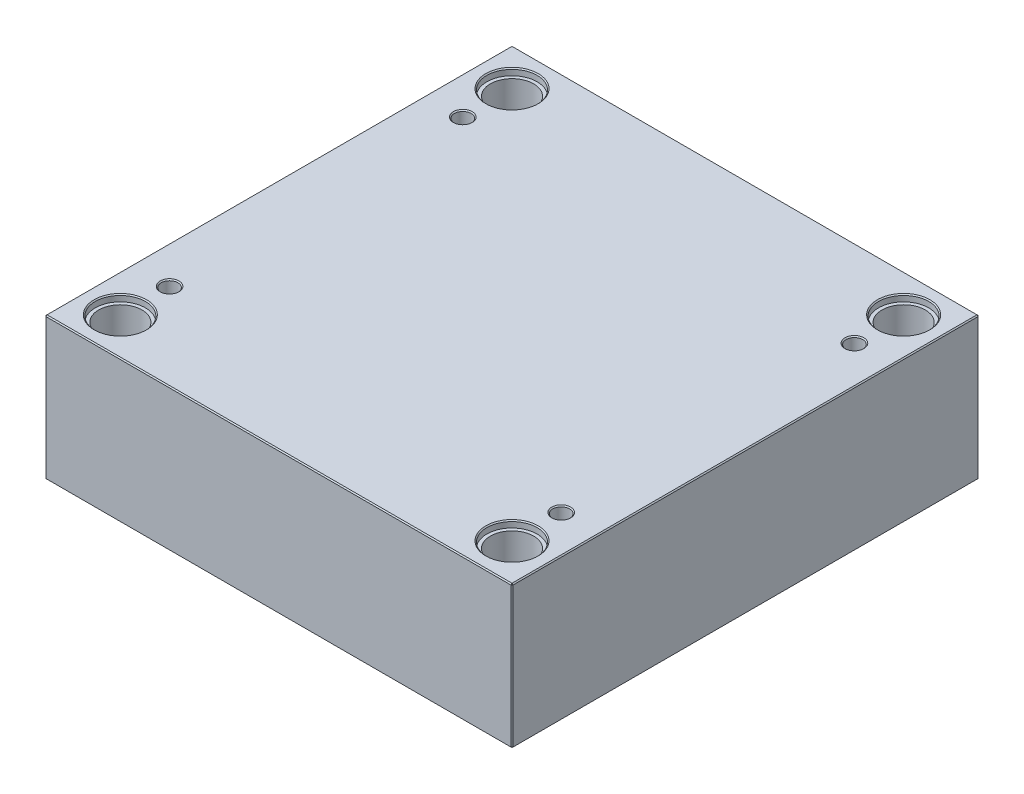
ISO-10303-21;
HEADER;
FILE_DESCRIPTION(('STEP AP214'),'2;1');
FILE_NAME('part.step','',(''),(''),'','','');
FILE_SCHEMA(('AUTOMOTIVE_DESIGN { 1 0 10303 214 1 1 1 1 }'));
ENDSEC;
DATA;
#1=APPLICATION_CONTEXT('core data for automotive mechanical design processes');
#2=APPLICATION_PROTOCOL_DEFINITION('international standard','automotive_design',2000,#1);
#3=PRODUCT_CONTEXT('',#1,'mechanical');
#4=PRODUCT('Part','Part','',(#3));
#5=PRODUCT_RELATED_PRODUCT_CATEGORY('part','',(#4));
#6=PRODUCT_DEFINITION_FORMATION('','',#4);
#7=PRODUCT_DEFINITION_CONTEXT('part definition',#1,'design');
#8=PRODUCT_DEFINITION('design','',#6,#7);
#9=PRODUCT_DEFINITION_SHAPE('','',#8);
#10=(LENGTH_UNIT() NAMED_UNIT(*) SI_UNIT(.MILLI.,.METRE.));
#11=(NAMED_UNIT(*) PLANE_ANGLE_UNIT() SI_UNIT($,.RADIAN.));
#12=(NAMED_UNIT(*) SI_UNIT($,.STERADIAN.) SOLID_ANGLE_UNIT());
#13=UNCERTAINTY_MEASURE_WITH_UNIT(LENGTH_MEASURE(1.E-05),#10,'distance_accuracy_value','');
#14=(GEOMETRIC_REPRESENTATION_CONTEXT(3) GLOBAL_UNCERTAINTY_ASSIGNED_CONTEXT((#13)) GLOBAL_UNIT_ASSIGNED_CONTEXT((#10,
#11,#12)) REPRESENTATION_CONTEXT('',''));
#15=CARTESIAN_POINT('',(0.,0.,0.));
#16=DIRECTION('',(0.,0.,1.));
#17=DIRECTION('',(1.,0.,0.));
#18=AXIS2_PLACEMENT_3D('',#15,#16,#17);
#19=CARTESIAN_POINT('',(-187.,0.,-187.));
#20=DIRECTION('',(0.,1.,0.));
#21=DIRECTION('',(0.,0.,1.));
#22=AXIS2_PLACEMENT_3D('',#19,#20,#21);
#23=CYLINDRICAL_SURFACE('',#22,20.65);
#24=CARTESIAN_POINT('',(-187.,0.999999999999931,-187.));
#25=DIRECTION('',(0.,1.,0.));
#26=DIRECTION('',(0.,0.,1.));
#27=AXIS2_PLACEMENT_3D('',#24,#25,#26);
#28=CIRCLE('',#27,20.65);
#29=CARTESIAN_POINT('',(-187.,0.999999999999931,-166.35));
#30=VERTEX_POINT('',#29);
#31=EDGE_CURVE('E472',#30,#30,#28,.F.);
#32=ORIENTED_EDGE('',*,*,#31,.T.);
#33=EDGE_LOOP('',(#32));
#34=FACE_BOUND('',#33,.T.);
#35=CARTESIAN_POINT('',(-187.,129.7,-187.));
#36=DIRECTION('',(0.,1.,0.));
#37=DIRECTION('',(0.,0.,1.));
#38=AXIS2_PLACEMENT_3D('',#35,#36,#37);
#39=CIRCLE('',#38,20.65);
#40=CARTESIAN_POINT('',(-187.,129.7,-166.35));
#41=VERTEX_POINT('',#40);
#42=EDGE_CURVE('E221',#41,#41,#39,.F.);
#43=ORIENTED_EDGE('',*,*,#42,.F.);
#44=EDGE_LOOP('',(#43));
#45=FACE_BOUND('',#44,.T.);
#46=ADVANCED_FACE('F16',(#34,#45),#23,.F.);
#47=CARTESIAN_POINT('',(187.,0.,-187.));
#48=DIRECTION('',(0.,1.,0.));
#49=DIRECTION('',(0.,0.,1.));
#50=AXIS2_PLACEMENT_3D('',#47,#48,#49);
#51=CYLINDRICAL_SURFACE('',#50,20.65);
#52=CARTESIAN_POINT('',(187.,0.999999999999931,-187.));
#53=DIRECTION('',(0.,1.,0.));
#54=DIRECTION('',(0.,0.,1.));
#55=AXIS2_PLACEMENT_3D('',#52,#53,#54);
#56=CIRCLE('',#55,20.65);
#57=CARTESIAN_POINT('',(187.,0.999999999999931,-166.35));
#58=VERTEX_POINT('',#57);
#59=EDGE_CURVE('E474',#58,#58,#56,.F.);
#60=ORIENTED_EDGE('',*,*,#59,.T.);
#61=EDGE_LOOP('',(#60));
#62=FACE_BOUND('',#61,.T.);
#63=CARTESIAN_POINT('',(187.,129.7,-187.));
#64=DIRECTION('',(0.,1.,0.));
#65=DIRECTION('',(0.,0.,1.));
#66=AXIS2_PLACEMENT_3D('',#63,#64,#65);
#67=CIRCLE('',#66,20.65);
#68=CARTESIAN_POINT('',(187.,129.7,-166.35));
#69=VERTEX_POINT('',#68);
#70=EDGE_CURVE('E218',#69,#69,#67,.F.);
#71=ORIENTED_EDGE('',*,*,#70,.F.);
#72=EDGE_LOOP('',(#71));
#73=FACE_BOUND('',#72,.T.);
#74=ADVANCED_FACE('F263',(#62,#73),#51,.F.);
#75=CARTESIAN_POINT('',(187.,0.,187.));
#76=DIRECTION('',(0.,1.,0.));
#77=DIRECTION('',(0.,0.,1.));
#78=AXIS2_PLACEMENT_3D('',#75,#76,#77);
#79=CYLINDRICAL_SURFACE('',#78,20.65);
#80=CARTESIAN_POINT('',(187.,0.999999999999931,187.));
#81=DIRECTION('',(0.,1.,0.));
#82=DIRECTION('',(0.,0.,1.));
#83=AXIS2_PLACEMENT_3D('',#80,#81,#82);
#84=CIRCLE('',#83,20.65);
#85=CARTESIAN_POINT('',(187.,0.999999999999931,207.65));
#86=VERTEX_POINT('',#85);
#87=EDGE_CURVE('E477',#86,#86,#84,.F.);
#88=ORIENTED_EDGE('',*,*,#87,.T.);
#89=EDGE_LOOP('',(#88));
#90=FACE_BOUND('',#89,.T.);
#91=CARTESIAN_POINT('',(187.,129.7,187.));
#92=DIRECTION('',(0.,1.,0.));
#93=DIRECTION('',(0.,0.,1.));
#94=AXIS2_PLACEMENT_3D('',#91,#92,#93);
#95=CIRCLE('',#94,20.65);
#96=CARTESIAN_POINT('',(187.,129.7,207.65));
#97=VERTEX_POINT('',#96);
#98=EDGE_CURVE('E214',#97,#97,#95,.F.);
#99=ORIENTED_EDGE('',*,*,#98,.F.);
#100=EDGE_LOOP('',(#99));
#101=FACE_BOUND('',#100,.T.);
#102=ADVANCED_FACE('F270',(#90,#101),#79,.F.);
#103=CARTESIAN_POINT('',(-187.,0.,187.));
#104=DIRECTION('',(0.,1.,0.));
#105=DIRECTION('',(0.,0.,1.));
#106=AXIS2_PLACEMENT_3D('',#103,#104,#105);
#107=CYLINDRICAL_SURFACE('',#106,20.65);
#108=CARTESIAN_POINT('',(-187.,0.999999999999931,187.));
#109=DIRECTION('',(0.,1.,0.));
#110=DIRECTION('',(0.,0.,1.));
#111=AXIS2_PLACEMENT_3D('',#108,#109,#110);
#112=CIRCLE('',#111,20.65);
#113=CARTESIAN_POINT('',(-187.,0.999999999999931,207.65));
#114=VERTEX_POINT('',#113);
#115=EDGE_CURVE('E480',#114,#114,#112,.F.);
#116=ORIENTED_EDGE('',*,*,#115,.T.);
#117=EDGE_LOOP('',(#116));
#118=FACE_BOUND('',#117,.T.);
#119=CARTESIAN_POINT('',(-187.,129.7,187.));
#120=DIRECTION('',(0.,1.,0.));
#121=DIRECTION('',(0.,0.,1.));
#122=AXIS2_PLACEMENT_3D('',#119,#120,#121);
#123=CIRCLE('',#122,20.65);
#124=CARTESIAN_POINT('',(-187.,129.7,207.65));
#125=VERTEX_POINT('',#124);
#126=EDGE_CURVE('E211',#125,#125,#123,.F.);
#127=ORIENTED_EDGE('',*,*,#126,.F.);
#128=EDGE_LOOP('',(#127));
#129=FACE_BOUND('',#128,.T.);
#130=ADVANCED_FACE('F277',(#118,#129),#107,.F.);
#131=CARTESIAN_POINT('',(-223.,136.,223.));
#132=DIRECTION('',(1.,0.,0.));
#133=DIRECTION('',(0.,0.,-1.));
#134=AXIS2_PLACEMENT_3D('',#131,#132,#133);
#135=PLANE('',#134);
#136=DIRECTION('',(0.,-1.,0.));
#137=VECTOR('',#136,1.);
#138=CARTESIAN_POINT('',(-223.,136.,-222.));
#139=LINE('',#138,#137);
#140=CARTESIAN_POINT('',(-223.,135.,-222.));
#141=VERTEX_POINT('',#140);
#142=CARTESIAN_POINT('',(-223.,0.999999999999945,-222.));
#143=VERTEX_POINT('',#142);
#144=EDGE_CURVE('E487',#141,#143,#139,.T.);
#145=ORIENTED_EDGE('',*,*,#144,.T.);
#146=DIRECTION('',(0.,0.,1.));
#147=VECTOR('',#146,1.);
#148=CARTESIAN_POINT('',(-223.,0.999999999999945,223.));
#149=LINE('',#148,#147);
#150=CARTESIAN_POINT('',(-223.,0.999999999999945,222.));
#151=VERTEX_POINT('',#150);
#152=EDGE_CURVE('E490',#143,#151,#149,.T.);
#153=ORIENTED_EDGE('',*,*,#152,.T.);
#154=DIRECTION('',(0.,1.,0.));
#155=VECTOR('',#154,1.);
#156=CARTESIAN_POINT('',(-223.,136.,222.));
#157=LINE('',#156,#155);
#158=CARTESIAN_POINT('',(-223.,135.,222.));
#159=VERTEX_POINT('',#158);
#160=EDGE_CURVE('E485',#151,#159,#157,.T.);
#161=ORIENTED_EDGE('',*,*,#160,.T.);
#162=DIRECTION('',(0.,0.,-1.));
#163=VECTOR('',#162,1.);
#164=CARTESIAN_POINT('',(-223.,135.,-223.));
#165=LINE('',#164,#163);
#166=EDGE_CURVE('E483',#159,#141,#165,.T.);
#167=ORIENTED_EDGE('',*,*,#166,.T.);
#168=EDGE_LOOP('',(#145,#153,#161,#167));
#169=FACE_BOUND('',#168,.T.);
#170=ADVANCED_FACE('F298',(#169),#135,.F.);
#171=CARTESIAN_POINT('',(223.,136.,223.));
#172=DIRECTION('',(0.,0.,-1.));
#173=DIRECTION('',(-1.,0.,0.));
#174=AXIS2_PLACEMENT_3D('',#171,#172,#173);
#175=PLANE('',#174);
#176=DIRECTION('',(-1.,0.,0.));
#177=VECTOR('',#176,1.);
#178=CARTESIAN_POINT('',(-223.,135.,223.));
#179=LINE('',#178,#177);
#180=CARTESIAN_POINT('',(222.,135.,223.));
#181=VERTEX_POINT('',#180);
#182=CARTESIAN_POINT('',(-222.,135.,223.));
#183=VERTEX_POINT('',#182);
#184=EDGE_CURVE('E509',#181,#183,#179,.T.);
#185=ORIENTED_EDGE('',*,*,#184,.T.);
#186=DIRECTION('',(0.,-1.,0.));
#187=VECTOR('',#186,1.);
#188=CARTESIAN_POINT('',(-222.,136.,223.));
#189=LINE('',#188,#187);
#190=CARTESIAN_POINT('',(-222.,0.999999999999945,223.));
#191=VERTEX_POINT('',#190);
#192=EDGE_CURVE('E515',#183,#191,#189,.T.);
#193=ORIENTED_EDGE('',*,*,#192,.T.);
#194=DIRECTION('',(1.,0.,0.));
#195=VECTOR('',#194,1.);
#196=CARTESIAN_POINT('',(223.,0.999999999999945,223.));
#197=LINE('',#196,#195);
#198=CARTESIAN_POINT('',(222.,0.999999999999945,223.));
#199=VERTEX_POINT('',#198);
#200=EDGE_CURVE('E513',#191,#199,#197,.T.);
#201=ORIENTED_EDGE('',*,*,#200,.T.);
#202=DIRECTION('',(0.,1.,0.));
#203=VECTOR('',#202,1.);
#204=CARTESIAN_POINT('',(222.,136.,223.));
#205=LINE('',#204,#203);
#206=EDGE_CURVE('E511',#199,#181,#205,.T.);
#207=ORIENTED_EDGE('',*,*,#206,.T.);
#208=EDGE_LOOP('',(#185,#193,#201,#207));
#209=FACE_BOUND('',#208,.T.);
#210=ADVANCED_FACE('F294',(#209),#175,.F.);
#211=CARTESIAN_POINT('',(223.,136.,223.));
#212=DIRECTION('',(-1.,0.,0.));
#213=DIRECTION('',(0.,0.,1.));
#214=AXIS2_PLACEMENT_3D('',#211,#212,#213);
#215=PLANE('',#214);
#216=DIRECTION('',(0.,0.,-1.));
#217=VECTOR('',#216,1.);
#218=CARTESIAN_POINT('',(223.,0.999999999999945,223.));
#219=LINE('',#218,#217);
#220=CARTESIAN_POINT('',(223.,0.999999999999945,222.));
#221=VERTEX_POINT('',#220);
#222=CARTESIAN_POINT('',(223.,0.999999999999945,-222.));
#223=VERTEX_POINT('',#222);
#224=EDGE_CURVE('E504',#221,#223,#219,.T.);
#225=ORIENTED_EDGE('',*,*,#224,.T.);
#226=DIRECTION('',(0.,1.,0.));
#227=VECTOR('',#226,1.);
#228=CARTESIAN_POINT('',(223.,136.,-222.));
#229=LINE('',#228,#227);
#230=CARTESIAN_POINT('',(223.,135.,-222.));
#231=VERTEX_POINT('',#230);
#232=EDGE_CURVE('E506',#223,#231,#229,.T.);
#233=ORIENTED_EDGE('',*,*,#232,.T.);
#234=DIRECTION('',(0.,0.,1.));
#235=VECTOR('',#234,1.);
#236=CARTESIAN_POINT('',(223.,135.,223.));
#237=LINE('',#236,#235);
#238=CARTESIAN_POINT('',(223.,135.,222.));
#239=VERTEX_POINT('',#238);
#240=EDGE_CURVE('E500',#231,#239,#237,.T.);
#241=ORIENTED_EDGE('',*,*,#240,.T.);
#242=DIRECTION('',(0.,-1.,0.));
#243=VECTOR('',#242,1.);
#244=CARTESIAN_POINT('',(223.,136.,222.));
#245=LINE('',#244,#243);
#246=EDGE_CURVE('E502',#239,#221,#245,.T.);
#247=ORIENTED_EDGE('',*,*,#246,.T.);
#248=EDGE_LOOP('',(#225,#233,#241,#247));
#249=FACE_BOUND('',#248,.T.);
#250=ADVANCED_FACE('F290',(#249),#215,.F.);
#251=CARTESIAN_POINT('',(223.,136.,-223.));
#252=DIRECTION('',(0.,0.,1.));
#253=DIRECTION('',(1.,0.,0.));
#254=AXIS2_PLACEMENT_3D('',#251,#252,#253);
#255=PLANE('',#254);
#256=DIRECTION('',(0.,-1.,0.));
#257=VECTOR('',#256,1.);
#258=CARTESIAN_POINT('',(222.,136.,-223.));
#259=LINE('',#258,#257);
#260=CARTESIAN_POINT('',(222.,135.,-223.));
#261=VERTEX_POINT('',#260);
#262=CARTESIAN_POINT('',(222.,0.999999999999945,-223.));
#263=VERTEX_POINT('',#262);
#264=EDGE_CURVE('E494',#261,#263,#259,.T.);
#265=ORIENTED_EDGE('',*,*,#264,.T.);
#266=DIRECTION('',(-1.,0.,0.));
#267=VECTOR('',#266,1.);
#268=CARTESIAN_POINT('',(223.,0.999999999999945,-223.));
#269=LINE('',#268,#267);
#270=CARTESIAN_POINT('',(-222.,0.999999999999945,-223.));
#271=VERTEX_POINT('',#270);
#272=EDGE_CURVE('E138',#263,#271,#269,.T.);
#273=ORIENTED_EDGE('',*,*,#272,.T.);
#274=DIRECTION('',(0.,1.,0.));
#275=VECTOR('',#274,1.);
#276=CARTESIAN_POINT('',(-222.,136.,-223.));
#277=LINE('',#276,#275);
#278=CARTESIAN_POINT('',(-222.,135.,-223.));
#279=VERTEX_POINT('',#278);
#280=EDGE_CURVE('E496',#271,#279,#277,.T.);
#281=ORIENTED_EDGE('',*,*,#280,.T.);
#282=DIRECTION('',(1.,0.,0.));
#283=VECTOR('',#282,1.);
#284=CARTESIAN_POINT('',(223.,135.,-223.));
#285=LINE('',#284,#283);
#286=EDGE_CURVE('E492',#279,#261,#285,.T.);
#287=ORIENTED_EDGE('',*,*,#286,.T.);
#288=EDGE_LOOP('',(#265,#273,#281,#287));
#289=FACE_BOUND('',#288,.T.);
#290=ADVANCED_FACE('F282',(#289),#255,.F.);
#291=CARTESIAN_POINT('',(0.,136.,0.));
#292=DIRECTION('',(0.,1.,0.));
#293=DIRECTION('',(0.,0.,1.));
#294=AXIS2_PLACEMENT_3D('',#291,#292,#293);
#295=PLANE('',#294);
#296=CARTESIAN_POINT('',(187.,136.,187.));
#297=DIRECTION('',(0.,1.,0.));
#298=DIRECTION('',(0.,0.,1.));
#299=AXIS2_PLACEMENT_3D('',#296,#297,#298);
#300=CIRCLE('',#299,25.);
#301=CARTESIAN_POINT('',(187.,136.,212.));
#302=VERTEX_POINT('',#301);
#303=EDGE_CURVE('E236',#302,#302,#300,.F.);
#304=ORIENTED_EDGE('',*,*,#303,.T.);
#305=EDGE_LOOP('',(#304));
#306=FACE_BOUND('',#305,.T.);
#307=CARTESIAN_POINT('',(-187.,136.,187.));
#308=DIRECTION('',(0.,1.,0.));
#309=DIRECTION('',(0.,0.,1.));
#310=AXIS2_PLACEMENT_3D('',#307,#308,#309);
#311=CIRCLE('',#310,25.);
#312=CARTESIAN_POINT('',(-187.,136.,212.));
#313=VERTEX_POINT('',#312);
#314=EDGE_CURVE('E233',#313,#313,#311,.F.);
#315=ORIENTED_EDGE('',*,*,#314,.T.);
#316=EDGE_LOOP('',(#315));
#317=FACE_BOUND('',#316,.T.);
#318=CARTESIAN_POINT('',(187.,136.,-187.));
#319=DIRECTION('',(0.,1.,0.));
#320=DIRECTION('',(0.,0.,1.));
#321=AXIS2_PLACEMENT_3D('',#318,#319,#320);
#322=CIRCLE('',#321,25.);
#323=CARTESIAN_POINT('',(187.,136.,-162.));
#324=VERTEX_POINT('',#323);
#325=EDGE_CURVE('E230',#324,#324,#322,.F.);
#326=ORIENTED_EDGE('',*,*,#325,.T.);
#327=EDGE_LOOP('',(#326));
#328=FACE_BOUND('',#327,.T.);
#329=CARTESIAN_POINT('',(-187.,136.,-187.));
#330=DIRECTION('',(0.,1.,0.));
#331=DIRECTION('',(0.,0.,1.));
#332=AXIS2_PLACEMENT_3D('',#329,#330,#331);
#333=CIRCLE('',#332,25.);
#334=CARTESIAN_POINT('',(-187.,136.,-162.));
#335=VERTEX_POINT('',#334);
#336=EDGE_CURVE('E227',#335,#335,#333,.F.);
#337=ORIENTED_EDGE('',*,*,#336,.T.);
#338=EDGE_LOOP('',(#337));
#339=FACE_BOUND('',#338,.T.);
#340=CARTESIAN_POINT('',(-187.,136.,140.));
#341=DIRECTION('',(0.,1.,0.));
#342=DIRECTION('',(0.,0.,1.));
#343=AXIS2_PLACEMENT_3D('',#340,#341,#342);
#344=CIRCLE('',#343,9.);
#345=CARTESIAN_POINT('',(-187.,136.,149.));
#346=VERTEX_POINT('',#345);
#347=EDGE_CURVE('E198',#346,#346,#344,.F.);
#348=ORIENTED_EDGE('',*,*,#347,.T.);
#349=EDGE_LOOP('',(#348));
#350=FACE_BOUND('',#349,.T.);
#351=CARTESIAN_POINT('',(187.,136.,140.));
#352=DIRECTION('',(0.,1.,0.));
#353=DIRECTION('',(0.,0.,1.));
#354=AXIS2_PLACEMENT_3D('',#351,#352,#353);
#355=CIRCLE('',#354,9.);
#356=CARTESIAN_POINT('',(187.,136.,149.));
#357=VERTEX_POINT('',#356);
#358=EDGE_CURVE('E195',#357,#357,#355,.F.);
#359=ORIENTED_EDGE('',*,*,#358,.T.);
#360=EDGE_LOOP('',(#359));
#361=FACE_BOUND('',#360,.T.);
#362=CARTESIAN_POINT('',(187.,136.,-140.));
#363=DIRECTION('',(0.,1.,0.));
#364=DIRECTION('',(0.,0.,1.));
#365=AXIS2_PLACEMENT_3D('',#362,#363,#364);
#366=CIRCLE('',#365,9.);
#367=CARTESIAN_POINT('',(187.,136.,-131.));
#368=VERTEX_POINT('',#367);
#369=EDGE_CURVE('E192',#368,#368,#366,.F.);
#370=ORIENTED_EDGE('',*,*,#369,.T.);
#371=EDGE_LOOP('',(#370));
#372=FACE_BOUND('',#371,.T.);
#373=CARTESIAN_POINT('',(-187.,136.,-140.));
#374=DIRECTION('',(0.,1.,0.));
#375=DIRECTION('',(0.,0.,1.));
#376=AXIS2_PLACEMENT_3D('',#373,#374,#375);
#377=CIRCLE('',#376,9.);
#378=CARTESIAN_POINT('',(-187.,136.,-131.));
#379=VERTEX_POINT('',#378);
#380=EDGE_CURVE('E188',#379,#379,#377,.F.);
#381=ORIENTED_EDGE('',*,*,#380,.T.);
#382=EDGE_LOOP('',(#381));
#383=FACE_BOUND('',#382,.T.);
#384=DIRECTION('',(0.,0.,-1.));
#385=VECTOR('',#384,1.);
#386=CARTESIAN_POINT('',(222.,136.,-223.));
#387=LINE('',#386,#385);
#388=CARTESIAN_POINT('',(222.,136.,222.));
#389=VERTEX_POINT('',#388);
#390=CARTESIAN_POINT('',(222.,136.,-222.));
#391=VERTEX_POINT('',#390);
#392=EDGE_CURVE('E31',#389,#391,#387,.T.);
#393=ORIENTED_EDGE('',*,*,#392,.T.);
#394=DIRECTION('',(-1.,0.,0.));
#395=VECTOR('',#394,1.);
#396=CARTESIAN_POINT('',(-223.,136.,-222.));
#397=LINE('',#396,#395);
#398=CARTESIAN_POINT('',(-222.,136.,-222.));
#399=VERTEX_POINT('',#398);
#400=EDGE_CURVE('E189',#391,#399,#397,.T.);
#401=ORIENTED_EDGE('',*,*,#400,.T.);
#402=DIRECTION('',(0.,0.,1.));
#403=VECTOR('',#402,1.);
#404=CARTESIAN_POINT('',(-222.,136.,223.));
#405=LINE('',#404,#403);
#406=CARTESIAN_POINT('',(-222.,136.,222.));
#407=VERTEX_POINT('',#406);
#408=EDGE_CURVE('E518',#399,#407,#405,.T.);
#409=ORIENTED_EDGE('',*,*,#408,.T.);
#410=DIRECTION('',(1.,0.,0.));
#411=VECTOR('',#410,1.);
#412=CARTESIAN_POINT('',(223.,136.,222.));
#413=LINE('',#412,#411);
#414=EDGE_CURVE('E36',#407,#389,#413,.T.);
#415=ORIENTED_EDGE('',*,*,#414,.T.);
#416=EDGE_LOOP('',(#393,#401,#409,#415));
#417=FACE_BOUND('',#416,.T.);
#418=ADVANCED_FACE('F279',(#306,#317,#328,#339,#350,#361,#372,#383,#417),#295,.T.);
#419=CARTESIAN_POINT('',(0.,0.,0.));
#420=DIRECTION('',(0.,1.,0.));
#421=DIRECTION('',(0.,0.,1.));
#422=AXIS2_PLACEMENT_3D('',#419,#420,#421);
#423=PLANE('',#422);
#424=CARTESIAN_POINT('',(-187.,0.,-187.));
#425=DIRECTION('',(0.,1.,0.));
#426=DIRECTION('',(0.,0.,1.));
#427=AXIS2_PLACEMENT_3D('',#424,#425,#426);
#428=CIRCLE('',#427,21.65);
#429=CARTESIAN_POINT('',(-187.,0.,-165.35));
#430=VERTEX_POINT('',#429);
#431=EDGE_CURVE('E469',#430,#430,#428,.T.);
#432=ORIENTED_EDGE('',*,*,#431,.T.);
#433=EDGE_LOOP('',(#432));
#434=FACE_BOUND('',#433,.T.);
#435=CARTESIAN_POINT('',(187.,0.,-187.));
#436=DIRECTION('',(0.,1.,0.));
#437=DIRECTION('',(0.,0.,1.));
#438=AXIS2_PLACEMENT_3D('',#435,#436,#437);
#439=CIRCLE('',#438,21.65);
#440=CARTESIAN_POINT('',(187.,0.,-165.35));
#441=VERTEX_POINT('',#440);
#442=EDGE_CURVE('E466',#441,#441,#439,.T.);
#443=ORIENTED_EDGE('',*,*,#442,.T.);
#444=EDGE_LOOP('',(#443));
#445=FACE_BOUND('',#444,.T.);
#446=CARTESIAN_POINT('',(187.,0.,187.));
#447=DIRECTION('',(0.,1.,0.));
#448=DIRECTION('',(0.,0.,1.));
#449=AXIS2_PLACEMENT_3D('',#446,#447,#448);
#450=CIRCLE('',#449,21.65);
#451=CARTESIAN_POINT('',(187.,0.,208.65));
#452=VERTEX_POINT('',#451);
#453=EDGE_CURVE('E463',#452,#452,#450,.T.);
#454=ORIENTED_EDGE('',*,*,#453,.T.);
#455=EDGE_LOOP('',(#454));
#456=FACE_BOUND('',#455,.T.);
#457=CARTESIAN_POINT('',(-187.,0.,187.));
#458=DIRECTION('',(0.,1.,0.));
#459=DIRECTION('',(0.,0.,1.));
#460=AXIS2_PLACEMENT_3D('',#457,#458,#459);
#461=CIRCLE('',#460,21.65);
#462=CARTESIAN_POINT('',(-187.,0.,208.65));
#463=VERTEX_POINT('',#462);
#464=EDGE_CURVE('E460',#463,#463,#461,.T.);
#465=ORIENTED_EDGE('',*,*,#464,.T.);
#466=EDGE_LOOP('',(#465));
#467=FACE_BOUND('',#466,.T.);
#468=DIRECTION('',(0.,0.,1.));
#469=VECTOR('',#468,1.);
#470=CARTESIAN_POINT('',(222.,0.,0.));
#471=LINE('',#470,#469);
#472=CARTESIAN_POINT('',(222.,0.,-222.));
#473=VERTEX_POINT('',#472);
#474=CARTESIAN_POINT('',(222.,0.,222.));
#475=VERTEX_POINT('',#474);
#476=EDGE_CURVE('E108',#473,#475,#471,.T.);
#477=ORIENTED_EDGE('',*,*,#476,.T.);
#478=DIRECTION('',(-1.,0.,0.));
#479=VECTOR('',#478,1.);
#480=CARTESIAN_POINT('',(0.,0.,222.));
#481=LINE('',#480,#479);
#482=CARTESIAN_POINT('',(-222.,0.,222.));
#483=VERTEX_POINT('',#482);
#484=EDGE_CURVE('E458',#475,#483,#481,.T.);
#485=ORIENTED_EDGE('',*,*,#484,.T.);
#486=DIRECTION('',(0.,0.,-1.));
#487=VECTOR('',#486,1.);
#488=CARTESIAN_POINT('',(-222.,0.,0.));
#489=LINE('',#488,#487);
#490=CARTESIAN_POINT('',(-222.,0.,-222.));
#491=VERTEX_POINT('',#490);
#492=EDGE_CURVE('E110',#483,#491,#489,.T.);
#493=ORIENTED_EDGE('',*,*,#492,.T.);
#494=DIRECTION('',(1.,0.,0.));
#495=VECTOR('',#494,1.);
#496=CARTESIAN_POINT('',(0.,0.,-222.));
#497=LINE('',#496,#495);
#498=EDGE_CURVE('E104',#491,#473,#497,.T.);
#499=ORIENTED_EDGE('',*,*,#498,.T.);
#500=EDGE_LOOP('',(#477,#485,#493,#499));
#501=FACE_BOUND('',#500,.T.);
#502=ADVANCED_FACE('F106',(#434,#445,#456,#467,#501),#423,.F.);
#503=CARTESIAN_POINT('',(-187.,0.,-187.));
#504=DIRECTION('',(0.,-1.,0.));
#505=DIRECTION('',(0.,0.,-1.));
#506=AXIS2_PLACEMENT_3D('',#503,#504,#505);
#507=CONICAL_SURFACE('',#506,21.65,0.785398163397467);
#508=ORIENTED_EDGE('',*,*,#31,.F.);
#509=EDGE_LOOP('',(#508));
#510=FACE_BOUND('',#509,.T.);
#511=ORIENTED_EDGE('',*,*,#431,.F.);
#512=EDGE_LOOP('',(#511));
#513=FACE_BOUND('',#512,.T.);
#514=ADVANCED_FACE('F286',(#510,#513),#507,.F.);
#515=CARTESIAN_POINT('',(187.,0.,-187.));
#516=DIRECTION('',(0.,-1.,0.));
#517=DIRECTION('',(0.,0.,-1.));
#518=AXIS2_PLACEMENT_3D('',#515,#516,#517);
#519=CONICAL_SURFACE('',#518,21.65,0.785398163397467);
#520=ORIENTED_EDGE('',*,*,#59,.F.);
#521=EDGE_LOOP('',(#520));
#522=FACE_BOUND('',#521,.T.);
#523=ORIENTED_EDGE('',*,*,#442,.F.);
#524=EDGE_LOOP('',(#523));
#525=FACE_BOUND('',#524,.T.);
#526=ADVANCED_FACE('F305',(#522,#525),#519,.F.);
#527=CARTESIAN_POINT('',(187.,0.,187.));
#528=DIRECTION('',(0.,-1.,0.));
#529=DIRECTION('',(0.,0.,-1.));
#530=AXIS2_PLACEMENT_3D('',#527,#528,#529);
#531=CONICAL_SURFACE('',#530,21.65,0.785398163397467);
#532=ORIENTED_EDGE('',*,*,#87,.F.);
#533=EDGE_LOOP('',(#532));
#534=FACE_BOUND('',#533,.T.);
#535=ORIENTED_EDGE('',*,*,#453,.F.);
#536=EDGE_LOOP('',(#535));
#537=FACE_BOUND('',#536,.T.);
#538=ADVANCED_FACE('F309',(#534,#537),#531,.F.);
#539=CARTESIAN_POINT('',(-187.,0.,187.));
#540=DIRECTION('',(0.,-1.,0.));
#541=DIRECTION('',(0.,0.,-1.));
#542=AXIS2_PLACEMENT_3D('',#539,#540,#541);
#543=CONICAL_SURFACE('',#542,21.65,0.785398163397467);
#544=ORIENTED_EDGE('',*,*,#115,.F.);
#545=EDGE_LOOP('',(#544));
#546=FACE_BOUND('',#545,.T.);
#547=ORIENTED_EDGE('',*,*,#464,.F.);
#548=EDGE_LOOP('',(#547));
#549=FACE_BOUND('',#548,.T.);
#550=ADVANCED_FACE('F313',(#546,#549),#543,.F.);
#551=CARTESIAN_POINT('',(223.,136.,222.));
#552=DIRECTION('',(-0.707106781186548,0.,-0.707106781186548));
#553=DIRECTION('',(0.,-1.,0.));
#554=AXIS2_PLACEMENT_3D('',#551,#552,#553);
#555=PLANE('',#554);
#556=DIRECTION('',(-0.707106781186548,0.,0.707106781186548));
#557=VECTOR('',#556,1.);
#558=CARTESIAN_POINT('',(222.,135.,223.));
#559=LINE('',#558,#557);
#560=EDGE_CURVE('E126',#181,#239,#559,.F.);
#561=ORIENTED_EDGE('',*,*,#560,.F.);
#562=ORIENTED_EDGE('',*,*,#206,.F.);
#563=DIRECTION('',(0.707106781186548,0.,-0.707106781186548));
#564=VECTOR('',#563,1.);
#565=CARTESIAN_POINT('',(222.,0.999999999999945,223.));
#566=LINE('',#565,#564);
#567=EDGE_CURVE('E180',#221,#199,#566,.F.);
#568=ORIENTED_EDGE('',*,*,#567,.F.);
#569=ORIENTED_EDGE('',*,*,#246,.F.);
#570=EDGE_LOOP('',(#561,#562,#568,#569));
#571=FACE_BOUND('',#570,.T.);
#572=ADVANCED_FACE('F317',(#571),#555,.F.);
#573=CARTESIAN_POINT('',(222.,135.,223.));
#574=DIRECTION('',(0.577350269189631,0.577350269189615,0.577350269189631));
#575=DIRECTION('',(0.707106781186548,0.,-0.707106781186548));
#576=AXIS2_PLACEMENT_3D('',#573,#574,#575);
#577=PLANE('',#576);
#578=DIRECTION('',(0.,-0.707106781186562,0.707106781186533));
#579=VECTOR('',#578,1.);
#580=CARTESIAN_POINT('',(222.,135.,223.));
#581=LINE('',#580,#579);
#582=EDGE_CURVE('E175',#181,#389,#581,.F.);
#583=ORIENTED_EDGE('',*,*,#582,.F.);
#584=ORIENTED_EDGE('',*,*,#560,.T.);
#585=DIRECTION('',(-0.707106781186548,0.707106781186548,0.));
#586=VECTOR('',#585,1.);
#587=CARTESIAN_POINT('',(222.5,135.5,222.));
#588=LINE('',#587,#586);
#589=EDGE_CURVE('E177',#389,#239,#588,.F.);
#590=ORIENTED_EDGE('',*,*,#589,.F.);
#591=EDGE_LOOP('',(#583,#584,#590));
#592=FACE_BOUND('',#591,.T.);
#593=ADVANCED_FACE('F385',(#592),#577,.T.);
#594=CARTESIAN_POINT('',(222.,0.999999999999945,223.));
#595=DIRECTION('',(0.577350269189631,-0.577350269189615,0.577350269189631));
#596=DIRECTION('',(0.707106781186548,0.,-0.707106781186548));
#597=AXIS2_PLACEMENT_3D('',#594,#595,#596);
#598=PLANE('',#597);
#599=DIRECTION('',(-0.707106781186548,-0.707106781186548,0.));
#600=VECTOR('',#599,1.);
#601=CARTESIAN_POINT('',(222.5,0.499999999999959,222.));
#602=LINE('',#601,#600);
#603=EDGE_CURVE('E124',#221,#475,#602,.T.);
#604=ORIENTED_EDGE('',*,*,#603,.F.);
#605=ORIENTED_EDGE('',*,*,#567,.T.);
#606=DIRECTION('',(0.,0.707106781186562,0.707106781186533));
#607=VECTOR('',#606,1.);
#608=CARTESIAN_POINT('',(222.,0.999999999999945,223.));
#609=LINE('',#608,#607);
#610=EDGE_CURVE('E172',#475,#199,#609,.T.);
#611=ORIENTED_EDGE('',*,*,#610,.F.);
#612=EDGE_LOOP('',(#604,#605,#611));
#613=FACE_BOUND('',#612,.T.);
#614=ADVANCED_FACE('F381',(#613),#598,.T.);
#615=CARTESIAN_POINT('',(222.,136.,0.));
#616=DIRECTION('',(0.707106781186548,0.707106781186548,0.));
#617=DIRECTION('',(0.,0.,1.));
#618=AXIS2_PLACEMENT_3D('',#615,#616,#617);
#619=PLANE('',#618);
#620=ORIENTED_EDGE('',*,*,#589,.T.);
#621=ORIENTED_EDGE('',*,*,#240,.F.);
#622=DIRECTION('',(0.707106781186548,-0.707106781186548,0.));
#623=VECTOR('',#622,1.);
#624=CARTESIAN_POINT('',(223.,135.,-222.));
#625=LINE('',#624,#623);
#626=EDGE_CURVE('E166',#391,#231,#625,.T.);
#627=ORIENTED_EDGE('',*,*,#626,.F.);
#628=ORIENTED_EDGE('',*,*,#392,.F.);
#629=EDGE_LOOP('',(#620,#621,#627,#628));
#630=FACE_BOUND('',#629,.T.);
#631=ADVANCED_FACE('F377',(#630),#619,.T.);
#632=CARTESIAN_POINT('',(0.,136.,222.));
#633=DIRECTION('',(0.,0.707106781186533,0.707106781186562));
#634=DIRECTION('',(-1.,0.,0.));
#635=AXIS2_PLACEMENT_3D('',#632,#633,#634);
#636=PLANE('',#635);
#637=ORIENTED_EDGE('',*,*,#582,.T.);
#638=ORIENTED_EDGE('',*,*,#414,.F.);
#639=DIRECTION('',(0.,0.707106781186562,-0.707106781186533));
#640=VECTOR('',#639,1.);
#641=CARTESIAN_POINT('',(-222.,135.5,222.5));
#642=LINE('',#641,#640);
#643=EDGE_CURVE('E163',#183,#407,#642,.T.);
#644=ORIENTED_EDGE('',*,*,#643,.F.);
#645=ORIENTED_EDGE('',*,*,#184,.F.);
#646=EDGE_LOOP('',(#637,#638,#644,#645));
#647=FACE_BOUND('',#646,.T.);
#648=ADVANCED_FACE('F373',(#647),#636,.T.);
#649=CARTESIAN_POINT('',(-222.,136.,223.));
#650=DIRECTION('',(0.707106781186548,0.,-0.707106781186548));
#651=DIRECTION('',(0.,-1.,0.));
#652=AXIS2_PLACEMENT_3D('',#649,#650,#651);
#653=PLANE('',#652);
#654=DIRECTION('',(0.707106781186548,0.,0.707106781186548));
#655=VECTOR('',#654,1.);
#656=CARTESIAN_POINT('',(-222.,0.999999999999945,223.));
#657=LINE('',#656,#655);
#658=EDGE_CURVE('E157',#191,#151,#657,.F.);
#659=ORIENTED_EDGE('',*,*,#658,.F.);
#660=ORIENTED_EDGE('',*,*,#192,.F.);
#661=DIRECTION('',(-0.707106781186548,0.,-0.707106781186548));
#662=VECTOR('',#661,1.);
#663=CARTESIAN_POINT('',(-223.,135.,222.));
#664=LINE('',#663,#662);
#665=EDGE_CURVE('E160',#159,#183,#664,.F.);
#666=ORIENTED_EDGE('',*,*,#665,.F.);
#667=ORIENTED_EDGE('',*,*,#160,.F.);
#668=EDGE_LOOP('',(#659,#660,#666,#667));
#669=FACE_BOUND('',#668,.T.);
#670=ADVANCED_FACE('F369',(#669),#653,.F.);
#671=CARTESIAN_POINT('',(223.,0.999999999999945,223.));
#672=DIRECTION('',(0.,0.707106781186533,-0.707106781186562));
#673=DIRECTION('',(1.,0.,0.));
#674=AXIS2_PLACEMENT_3D('',#671,#672,#673);
#675=PLANE('',#674);
#676=ORIENTED_EDGE('',*,*,#610,.T.);
#677=ORIENTED_EDGE('',*,*,#200,.F.);
#678=DIRECTION('',(0.,-0.707106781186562,-0.707106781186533));
#679=VECTOR('',#678,1.);
#680=CARTESIAN_POINT('',(-222.,0.999999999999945,223.));
#681=LINE('',#680,#679);
#682=EDGE_CURVE('E135',#483,#191,#681,.F.);
#683=ORIENTED_EDGE('',*,*,#682,.F.);
#684=ORIENTED_EDGE('',*,*,#484,.F.);
#685=EDGE_LOOP('',(#676,#677,#683,#684));
#686=FACE_BOUND('',#685,.T.);
#687=ADVANCED_FACE('F366',(#686),#675,.F.);
#688=CARTESIAN_POINT('',(223.,0.999999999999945,223.));
#689=DIRECTION('',(-0.707106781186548,0.707106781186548,0.));
#690=DIRECTION('',(0.,0.,-1.));
#691=AXIS2_PLACEMENT_3D('',#688,#689,#690);
#692=PLANE('',#691);
#693=ORIENTED_EDGE('',*,*,#603,.T.);
#694=ORIENTED_EDGE('',*,*,#476,.F.);
#695=DIRECTION('',(0.707106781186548,0.707106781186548,0.));
#696=VECTOR('',#695,1.);
#697=CARTESIAN_POINT('',(222.5,0.499999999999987,-222.));
#698=LINE('',#697,#696);
#699=EDGE_CURVE('E121',#223,#473,#698,.F.);
#700=ORIENTED_EDGE('',*,*,#699,.F.);
#701=ORIENTED_EDGE('',*,*,#224,.F.);
#702=EDGE_LOOP('',(#693,#694,#700,#701));
#703=FACE_BOUND('',#702,.T.);
#704=ADVANCED_FACE('F119',(#703),#692,.F.);
#705=CARTESIAN_POINT('',(222.,136.,-223.));
#706=DIRECTION('',(-0.707106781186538,0.,0.707106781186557));
#707=DIRECTION('',(0.,-1.,0.));
#708=AXIS2_PLACEMENT_3D('',#705,#706,#707);
#709=PLANE('',#708);
#710=DIRECTION('',(0.707106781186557,0.,0.707106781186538));
#711=VECTOR('',#710,1.);
#712=CARTESIAN_POINT('',(223.,135.,-222.));
#713=LINE('',#712,#711);
#714=EDGE_CURVE('E168',#231,#261,#713,.F.);
#715=ORIENTED_EDGE('',*,*,#714,.F.);
#716=ORIENTED_EDGE('',*,*,#232,.F.);
#717=DIRECTION('',(-0.707106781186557,0.,-0.707106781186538));
#718=VECTOR('',#717,1.);
#719=CARTESIAN_POINT('',(222.,0.999999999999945,-223.));
#720=LINE('',#719,#718);
#721=EDGE_CURVE('E134',#263,#223,#720,.F.);
#722=ORIENTED_EDGE('',*,*,#721,.F.);
#723=ORIENTED_EDGE('',*,*,#264,.F.);
#724=EDGE_LOOP('',(#715,#716,#722,#723));
#725=FACE_BOUND('',#724,.T.);
#726=ADVANCED_FACE('F359',(#725),#709,.F.);
#727=CARTESIAN_POINT('',(223.,135.,-222.));
#728=DIRECTION('',(0.577350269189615,0.577350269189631,-0.577350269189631));
#729=DIRECTION('',(0.,0.707106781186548,0.707106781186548));
#730=AXIS2_PLACEMENT_3D('',#727,#728,#729);
#731=PLANE('',#730);
#732=ORIENTED_EDGE('',*,*,#626,.T.);
#733=ORIENTED_EDGE('',*,*,#714,.T.);
#734=DIRECTION('',(0.,0.707106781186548,0.707106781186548));
#735=VECTOR('',#734,1.);
#736=CARTESIAN_POINT('',(222.,135.5,-222.5));
#737=LINE('',#736,#735);
#738=EDGE_CURVE('E152',#391,#261,#737,.F.);
#739=ORIENTED_EDGE('',*,*,#738,.F.);
#740=EDGE_LOOP('',(#732,#733,#739));
#741=FACE_BOUND('',#740,.T.);
#742=ADVANCED_FACE('F355',(#741),#731,.T.);
#743=CARTESIAN_POINT('',(-223.,135.,222.));
#744=DIRECTION('',(-0.577350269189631,0.577350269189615,0.577350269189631));
#745=DIRECTION('',(0.707106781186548,0.,0.707106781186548));
#746=AXIS2_PLACEMENT_3D('',#743,#744,#745);
#747=PLANE('',#746);
#748=ORIENTED_EDGE('',*,*,#665,.T.);
#749=ORIENTED_EDGE('',*,*,#643,.T.);
#750=DIRECTION('',(-0.707106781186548,-0.707106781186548,0.));
#751=VECTOR('',#750,1.);
#752=CARTESIAN_POINT('',(-223.,135.,222.));
#753=LINE('',#752,#751);
#754=EDGE_CURVE('E143',#159,#407,#753,.F.);
#755=ORIENTED_EDGE('',*,*,#754,.F.);
#756=EDGE_LOOP('',(#748,#749,#755));
#757=FACE_BOUND('',#756,.T.);
#758=ADVANCED_FACE('F351',(#757),#747,.T.);
#759=CARTESIAN_POINT('',(-222.,0.999999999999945,223.));
#760=DIRECTION('',(-0.577350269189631,-0.577350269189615,0.577350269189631));
#761=DIRECTION('',(0.707106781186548,0.,0.707106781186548));
#762=AXIS2_PLACEMENT_3D('',#759,#760,#761);
#763=PLANE('',#762);
#764=ORIENTED_EDGE('',*,*,#682,.T.);
#765=ORIENTED_EDGE('',*,*,#658,.T.);
#766=DIRECTION('',(-0.707106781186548,0.707106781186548,0.));
#767=VECTOR('',#766,1.);
#768=CARTESIAN_POINT('',(-222.5,0.499999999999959,222.));
#769=LINE('',#768,#767);
#770=EDGE_CURVE('E139',#483,#151,#769,.T.);
#771=ORIENTED_EDGE('',*,*,#770,.F.);
#772=EDGE_LOOP('',(#764,#765,#771));
#773=FACE_BOUND('',#772,.T.);
#774=ADVANCED_FACE('F348',(#773),#763,.T.);
#775=CARTESIAN_POINT('',(222.,0.999999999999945,-223.));
#776=DIRECTION('',(0.577350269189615,-0.577350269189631,-0.577350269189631));
#777=DIRECTION('',(0.,0.707106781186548,-0.707106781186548));
#778=AXIS2_PLACEMENT_3D('',#775,#776,#777);
#779=PLANE('',#778);
#780=ORIENTED_EDGE('',*,*,#721,.T.);
#781=ORIENTED_EDGE('',*,*,#699,.T.);
#782=DIRECTION('',(0.,-0.707106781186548,0.707106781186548));
#783=VECTOR('',#782,1.);
#784=CARTESIAN_POINT('',(222.,0.999999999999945,-223.));
#785=LINE('',#784,#783);
#786=EDGE_CURVE('E131',#263,#473,#785,.T.);
#787=ORIENTED_EDGE('',*,*,#786,.F.);
#788=EDGE_LOOP('',(#780,#781,#787));
#789=FACE_BOUND('',#788,.T.);
#790=ADVANCED_FACE('F130',(#789),#779,.T.);
#791=CARTESIAN_POINT('',(0.,136.,-222.));
#792=DIRECTION('',(0.,0.707106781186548,-0.707106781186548));
#793=DIRECTION('',(1.,0.,0.));
#794=AXIS2_PLACEMENT_3D('',#791,#792,#793);
#795=PLANE('',#794);
#796=ORIENTED_EDGE('',*,*,#738,.T.);
#797=ORIENTED_EDGE('',*,*,#286,.F.);
#798=DIRECTION('',(0.,-0.707106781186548,-0.707106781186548));
#799=VECTOR('',#798,1.);
#800=CARTESIAN_POINT('',(-222.,135.,-223.));
#801=LINE('',#800,#799);
#802=EDGE_CURVE('E140',#399,#279,#801,.T.);
#803=ORIENTED_EDGE('',*,*,#802,.F.);
#804=ORIENTED_EDGE('',*,*,#400,.F.);
#805=EDGE_LOOP('',(#796,#797,#803,#804));
#806=FACE_BOUND('',#805,.T.);
#807=ADVANCED_FACE('F341',(#806),#795,.T.);
#808=CARTESIAN_POINT('',(-222.,136.,0.));
#809=DIRECTION('',(-0.707106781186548,0.707106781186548,0.));
#810=DIRECTION('',(0.,0.,-1.));
#811=AXIS2_PLACEMENT_3D('',#808,#809,#810);
#812=PLANE('',#811);
#813=ORIENTED_EDGE('',*,*,#754,.T.);
#814=ORIENTED_EDGE('',*,*,#408,.F.);
#815=DIRECTION('',(0.707106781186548,0.707106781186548,0.));
#816=VECTOR('',#815,1.);
#817=CARTESIAN_POINT('',(-222.5,135.5,-222.));
#818=LINE('',#817,#816);
#819=EDGE_CURVE('E146',#141,#399,#818,.T.);
#820=ORIENTED_EDGE('',*,*,#819,.F.);
#821=ORIENTED_EDGE('',*,*,#166,.F.);
#822=EDGE_LOOP('',(#813,#814,#820,#821));
#823=FACE_BOUND('',#822,.T.);
#824=ADVANCED_FACE('F337',(#823),#812,.T.);
#825=CARTESIAN_POINT('',(-223.,0.999999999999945,223.));
#826=DIRECTION('',(0.707106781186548,0.707106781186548,0.));
#827=DIRECTION('',(0.,0.,1.));
#828=AXIS2_PLACEMENT_3D('',#825,#826,#827);
#829=PLANE('',#828);
#830=ORIENTED_EDGE('',*,*,#770,.T.);
#831=ORIENTED_EDGE('',*,*,#152,.F.);
#832=DIRECTION('',(0.707106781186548,-0.707106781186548,0.));
#833=VECTOR('',#832,1.);
#834=CARTESIAN_POINT('',(-223.,0.999999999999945,-222.));
#835=LINE('',#834,#833);
#836=EDGE_CURVE('E529',#491,#143,#835,.F.);
#837=ORIENTED_EDGE('',*,*,#836,.F.);
#838=ORIENTED_EDGE('',*,*,#492,.F.);
#839=EDGE_LOOP('',(#830,#831,#837,#838));
#840=FACE_BOUND('',#839,.T.);
#841=ADVANCED_FACE('F334',(#840),#829,.F.);
#842=CARTESIAN_POINT('',(223.,0.999999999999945,-223.));
#843=DIRECTION('',(0.,0.707106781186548,0.707106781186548));
#844=DIRECTION('',(-1.,0.,0.));
#845=AXIS2_PLACEMENT_3D('',#842,#843,#844);
#846=PLANE('',#845);
#847=ORIENTED_EDGE('',*,*,#786,.T.);
#848=ORIENTED_EDGE('',*,*,#498,.F.);
#849=DIRECTION('',(0.,0.707106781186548,-0.707106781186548));
#850=VECTOR('',#849,1.);
#851=CARTESIAN_POINT('',(-222.,0.499999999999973,-222.5));
#852=LINE('',#851,#850);
#853=EDGE_CURVE('E526',#271,#491,#852,.F.);
#854=ORIENTED_EDGE('',*,*,#853,.F.);
#855=ORIENTED_EDGE('',*,*,#272,.F.);
#856=EDGE_LOOP('',(#847,#848,#854,#855));
#857=FACE_BOUND('',#856,.T.);
#858=ADVANCED_FACE('F137',(#857),#846,.F.);
#859=CARTESIAN_POINT('',(-222.,135.,-223.));
#860=DIRECTION('',(-0.577350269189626,0.577350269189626,-0.577350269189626));
#861=DIRECTION('',(-0.707106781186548,0.,0.707106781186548));
#862=AXIS2_PLACEMENT_3D('',#859,#860,#861);
#863=PLANE('',#862);
#864=ORIENTED_EDGE('',*,*,#819,.T.);
#865=ORIENTED_EDGE('',*,*,#802,.T.);
#866=DIRECTION('',(0.707106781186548,0.,-0.707106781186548));
#867=VECTOR('',#866,1.);
#868=CARTESIAN_POINT('',(-222.,135.,-223.));
#869=LINE('',#868,#867);
#870=EDGE_CURVE('E524',#141,#279,#869,.T.);
#871=ORIENTED_EDGE('',*,*,#870,.F.);
#872=EDGE_LOOP('',(#864,#865,#871));
#873=FACE_BOUND('',#872,.T.);
#874=ADVANCED_FACE('F327',(#873),#863,.T.);
#875=CARTESIAN_POINT('',(-223.,0.999999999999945,-222.));
#876=DIRECTION('',(-0.577350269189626,-0.577350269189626,-0.577350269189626));
#877=DIRECTION('',(-0.707106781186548,0.,0.707106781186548));
#878=AXIS2_PLACEMENT_3D('',#875,#876,#877);
#879=PLANE('',#878);
#880=ORIENTED_EDGE('',*,*,#853,.T.);
#881=ORIENTED_EDGE('',*,*,#836,.T.);
#882=DIRECTION('',(-0.707106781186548,0.,0.707106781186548));
#883=VECTOR('',#882,1.);
#884=CARTESIAN_POINT('',(-223.,0.999999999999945,-222.));
#885=LINE('',#884,#883);
#886=EDGE_CURVE('E455',#271,#143,#885,.T.);
#887=ORIENTED_EDGE('',*,*,#886,.F.);
#888=EDGE_LOOP('',(#880,#881,#887));
#889=FACE_BOUND('',#888,.T.);
#890=ADVANCED_FACE('F323',(#889),#879,.T.);
#891=CARTESIAN_POINT('',(-223.,136.,-222.));
#892=DIRECTION('',(0.707106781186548,0.,0.707106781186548));
#893=DIRECTION('',(0.,-1.,0.));
#894=AXIS2_PLACEMENT_3D('',#891,#892,#893);
#895=PLANE('',#894);
#896=ORIENTED_EDGE('',*,*,#870,.T.);
#897=ORIENTED_EDGE('',*,*,#280,.F.);
#898=ORIENTED_EDGE('',*,*,#886,.T.);
#899=ORIENTED_EDGE('',*,*,#144,.F.);
#900=EDGE_LOOP('',(#896,#897,#898,#899));
#901=FACE_BOUND('',#900,.T.);
#902=ADVANCED_FACE('F319',(#901),#895,.F.);
#903=CARTESIAN_POINT('',(-187.,111.,-140.));
#904=DIRECTION('',(0.,1.,0.));
#905=DIRECTION('',(0.,0.,1.));
#906=AXIS2_PLACEMENT_3D('',#903,#904,#905);
#907=CYLINDRICAL_SURFACE('',#906,8.);
#908=CARTESIAN_POINT('',(-187.,135.,-140.));
#909=DIRECTION('',(0.,1.,0.));
#910=DIRECTION('',(0.,0.,1.));
#911=AXIS2_PLACEMENT_3D('',#908,#909,#910);
#912=CIRCLE('',#911,8.);
#913=CARTESIAN_POINT('',(-187.,135.,-132.));
#914=VERTEX_POINT('',#913);
#915=EDGE_CURVE('E207',#914,#914,#912,.T.);
#916=ORIENTED_EDGE('',*,*,#915,.T.);
#917=EDGE_LOOP('',(#916));
#918=FACE_BOUND('',#917,.T.);
#919=CARTESIAN_POINT('',(-187.,111.,-140.));
#920=DIRECTION('',(0.,1.,0.));
#921=DIRECTION('',(0.,0.,1.));
#922=AXIS2_PLACEMENT_3D('',#919,#920,#921);
#923=CIRCLE('',#922,8.);
#924=CARTESIAN_POINT('',(-187.,111.,-132.));
#925=VERTEX_POINT('',#924);
#926=EDGE_CURVE('E448',#925,#925,#923,.T.);
#927=ORIENTED_EDGE('',*,*,#926,.F.);
#928=EDGE_LOOP('',(#927));
#929=FACE_BOUND('',#928,.T.);
#930=ADVANCED_FACE('F322',(#918,#929),#907,.F.);
#931=CARTESIAN_POINT('',(-187.,111.,-140.));
#932=DIRECTION('',(0.,1.,0.));
#933=DIRECTION('',(0.,0.,1.));
#934=AXIS2_PLACEMENT_3D('',#931,#932,#933);
#935=PLANE('',#934);
#936=ORIENTED_EDGE('',*,*,#926,.T.);
#937=EDGE_LOOP('',(#936));
#938=FACE_BOUND('',#937,.T.);
#939=ADVANCED_FACE('F596',(#938),#935,.T.);
#940=CARTESIAN_POINT('',(187.,111.,-140.));
#941=DIRECTION('',(0.,1.,0.));
#942=DIRECTION('',(0.,0.,1.));
#943=AXIS2_PLACEMENT_3D('',#940,#941,#942);
#944=CYLINDRICAL_SURFACE('',#943,8.);
#945=CARTESIAN_POINT('',(187.,135.,-140.));
#946=DIRECTION('',(0.,1.,0.));
#947=DIRECTION('',(0.,0.,1.));
#948=AXIS2_PLACEMENT_3D('',#945,#946,#947);
#949=CIRCLE('',#948,8.);
#950=CARTESIAN_POINT('',(187.,135.,-132.));
#951=VERTEX_POINT('',#950);
#952=EDGE_CURVE('E204',#951,#951,#949,.T.);
#953=ORIENTED_EDGE('',*,*,#952,.T.);
#954=EDGE_LOOP('',(#953));
#955=FACE_BOUND('',#954,.T.);
#956=CARTESIAN_POINT('',(187.,111.,-140.));
#957=DIRECTION('',(0.,1.,0.));
#958=DIRECTION('',(0.,0.,1.));
#959=AXIS2_PLACEMENT_3D('',#956,#957,#958);
#960=CIRCLE('',#959,8.);
#961=CARTESIAN_POINT('',(187.,111.,-132.));
#962=VERTEX_POINT('',#961);
#963=EDGE_CURVE('E445',#962,#962,#960,.T.);
#964=ORIENTED_EDGE('',*,*,#963,.F.);
#965=EDGE_LOOP('',(#964));
#966=FACE_BOUND('',#965,.T.);
#967=ADVANCED_FACE('F592',(#955,#966),#944,.F.);
#968=CARTESIAN_POINT('',(187.,111.,-140.));
#969=DIRECTION('',(0.,1.,0.));
#970=DIRECTION('',(0.,0.,1.));
#971=AXIS2_PLACEMENT_3D('',#968,#969,#970);
#972=PLANE('',#971);
#973=ORIENTED_EDGE('',*,*,#963,.T.);
#974=EDGE_LOOP('',(#973));
#975=FACE_BOUND('',#974,.T.);
#976=ADVANCED_FACE('F588',(#975),#972,.T.);
#977=CARTESIAN_POINT('',(187.,111.,140.));
#978=DIRECTION('',(0.,1.,0.));
#979=DIRECTION('',(0.,0.,1.));
#980=AXIS2_PLACEMENT_3D('',#977,#978,#979);
#981=CYLINDRICAL_SURFACE('',#980,8.);
#982=CARTESIAN_POINT('',(187.,135.,140.));
#983=DIRECTION('',(0.,1.,0.));
#984=DIRECTION('',(0.,0.,1.));
#985=AXIS2_PLACEMENT_3D('',#982,#983,#984);
#986=CIRCLE('',#985,8.);
#987=CARTESIAN_POINT('',(187.,135.,148.));
#988=VERTEX_POINT('',#987);
#989=EDGE_CURVE('E201',#988,#988,#986,.T.);
#990=ORIENTED_EDGE('',*,*,#989,.T.);
#991=EDGE_LOOP('',(#990));
#992=FACE_BOUND('',#991,.T.);
#993=CARTESIAN_POINT('',(187.,111.,140.));
#994=DIRECTION('',(0.,1.,0.));
#995=DIRECTION('',(0.,0.,1.));
#996=AXIS2_PLACEMENT_3D('',#993,#994,#995);
#997=CIRCLE('',#996,8.);
#998=CARTESIAN_POINT('',(187.,111.,148.));
#999=VERTEX_POINT('',#998);
#1000=EDGE_CURVE('E449',#999,#999,#997,.T.);
#1001=ORIENTED_EDGE('',*,*,#1000,.F.);
#1002=EDGE_LOOP('',(#1001));
#1003=FACE_BOUND('',#1002,.T.);
#1004=ADVANCED_FACE('F591',(#992,#1003),#981,.F.);
#1005=CARTESIAN_POINT('',(187.,111.,140.));
#1006=DIRECTION('',(0.,1.,0.));
#1007=DIRECTION('',(0.,0.,1.));
#1008=AXIS2_PLACEMENT_3D('',#1005,#1006,#1007);
#1009=PLANE('',#1008);
#1010=ORIENTED_EDGE('',*,*,#1000,.T.);
#1011=EDGE_LOOP('',(#1010));
#1012=FACE_BOUND('',#1011,.T.);
#1013=ADVANCED_FACE('F598',(#1012),#1009,.T.);
#1014=CARTESIAN_POINT('',(-187.,111.,140.));
#1015=DIRECTION('',(0.,1.,0.));
#1016=DIRECTION('',(0.,0.,1.));
#1017=AXIS2_PLACEMENT_3D('',#1014,#1015,#1016);
#1018=CYLINDRICAL_SURFACE('',#1017,8.);
#1019=CARTESIAN_POINT('',(-187.,135.,140.));
#1020=DIRECTION('',(0.,1.,0.));
#1021=DIRECTION('',(0.,0.,1.));
#1022=AXIS2_PLACEMENT_3D('',#1019,#1020,#1021);
#1023=CIRCLE('',#1022,8.);
#1024=CARTESIAN_POINT('',(-187.,135.,148.));
#1025=VERTEX_POINT('',#1024);
#1026=EDGE_CURVE('E185',#1025,#1025,#1023,.T.);
#1027=ORIENTED_EDGE('',*,*,#1026,.T.);
#1028=EDGE_LOOP('',(#1027));
#1029=FACE_BOUND('',#1028,.T.);
#1030=CARTESIAN_POINT('',(-187.,111.,140.));
#1031=DIRECTION('',(0.,1.,0.));
#1032=DIRECTION('',(0.,0.,1.));
#1033=AXIS2_PLACEMENT_3D('',#1030,#1031,#1032);
#1034=CIRCLE('',#1033,8.);
#1035=CARTESIAN_POINT('',(-187.,111.,148.));
#1036=VERTEX_POINT('',#1035);
#1037=EDGE_CURVE('E224',#1036,#1036,#1034,.T.);
#1038=ORIENTED_EDGE('',*,*,#1037,.F.);
#1039=EDGE_LOOP('',(#1038));
#1040=FACE_BOUND('',#1039,.T.);
#1041=ADVANCED_FACE('F601',(#1029,#1040),#1018,.F.);
#1042=CARTESIAN_POINT('',(-187.,111.,140.));
#1043=DIRECTION('',(0.,1.,0.));
#1044=DIRECTION('',(0.,0.,1.));
#1045=AXIS2_PLACEMENT_3D('',#1042,#1043,#1044);
#1046=PLANE('',#1045);
#1047=ORIENTED_EDGE('',*,*,#1037,.T.);
#1048=EDGE_LOOP('',(#1047));
#1049=FACE_BOUND('',#1048,.T.);
#1050=ADVANCED_FACE('F397',(#1049),#1046,.T.);
#1051=CARTESIAN_POINT('',(-187.,135.,140.));
#1052=DIRECTION('',(0.,1.,0.));
#1053=DIRECTION('',(0.,0.,1.));
#1054=AXIS2_PLACEMENT_3D('',#1051,#1052,#1053);
#1055=CONICAL_SURFACE('',#1054,8.,0.785398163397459);
#1056=ORIENTED_EDGE('',*,*,#347,.F.);
#1057=EDGE_LOOP('',(#1056));
#1058=FACE_BOUND('',#1057,.T.);
#1059=ORIENTED_EDGE('',*,*,#1026,.F.);
#1060=EDGE_LOOP('',(#1059));
#1061=FACE_BOUND('',#1060,.T.);
#1062=ADVANCED_FACE('F393',(#1058,#1061),#1055,.F.);
#1063=CARTESIAN_POINT('',(187.,135.,140.));
#1064=DIRECTION('',(0.,1.,0.));
#1065=DIRECTION('',(0.,0.,1.));
#1066=AXIS2_PLACEMENT_3D('',#1063,#1064,#1065);
#1067=CONICAL_SURFACE('',#1066,8.,0.785398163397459);
#1068=ORIENTED_EDGE('',*,*,#358,.F.);
#1069=EDGE_LOOP('',(#1068));
#1070=FACE_BOUND('',#1069,.T.);
#1071=ORIENTED_EDGE('',*,*,#989,.F.);
#1072=EDGE_LOOP('',(#1071));
#1073=FACE_BOUND('',#1072,.T.);
#1074=ADVANCED_FACE('F396',(#1070,#1073),#1067,.F.);
#1075=CARTESIAN_POINT('',(187.,135.,-140.));
#1076=DIRECTION('',(0.,1.,0.));
#1077=DIRECTION('',(0.,0.,1.));
#1078=AXIS2_PLACEMENT_3D('',#1075,#1076,#1077);
#1079=CONICAL_SURFACE('',#1078,8.,0.785398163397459);
#1080=ORIENTED_EDGE('',*,*,#369,.F.);
#1081=EDGE_LOOP('',(#1080));
#1082=FACE_BOUND('',#1081,.T.);
#1083=ORIENTED_EDGE('',*,*,#952,.F.);
#1084=EDGE_LOOP('',(#1083));
#1085=FACE_BOUND('',#1084,.T.);
#1086=ADVANCED_FACE('F401',(#1082,#1085),#1079,.F.);
#1087=CARTESIAN_POINT('',(-187.,135.,-140.));
#1088=DIRECTION('',(0.,1.,0.));
#1089=DIRECTION('',(0.,0.,1.));
#1090=AXIS2_PLACEMENT_3D('',#1087,#1088,#1089);
#1091=CONICAL_SURFACE('',#1090,8.,0.785398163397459);
#1092=ORIENTED_EDGE('',*,*,#380,.F.);
#1093=EDGE_LOOP('',(#1092));
#1094=FACE_BOUND('',#1093,.T.);
#1095=ORIENTED_EDGE('',*,*,#915,.F.);
#1096=EDGE_LOOP('',(#1095));
#1097=FACE_BOUND('',#1096,.T.);
#1098=ADVANCED_FACE('F405',(#1094,#1097),#1091,.F.);
#1099=CARTESIAN_POINT('',(-187.,129.7,187.));
#1100=DIRECTION('',(0.,1.,0.));
#1101=DIRECTION('',(0.,0.,1.));
#1102=AXIS2_PLACEMENT_3D('',#1099,#1100,#1101);
#1103=PLANE('',#1102);
#1104=CARTESIAN_POINT('',(-187.,129.7,187.));
#1105=DIRECTION('',(0.,1.,0.));
#1106=DIRECTION('',(0.,0.,1.));
#1107=AXIS2_PLACEMENT_3D('',#1104,#1105,#1106);
#1108=CIRCLE('',#1107,24.);
#1109=CARTESIAN_POINT('',(-187.,129.7,211.));
#1110=VERTEX_POINT('',#1109);
#1111=EDGE_CURVE('E436',#1110,#1110,#1108,.T.);
#1112=ORIENTED_EDGE('',*,*,#1111,.T.);
#1113=EDGE_LOOP('',(#1112));
#1114=FACE_BOUND('',#1113,.T.);
#1115=ORIENTED_EDGE('',*,*,#126,.T.);
#1116=EDGE_LOOP('',(#1115));
#1117=FACE_BOUND('',#1116,.T.);
#1118=ADVANCED_FACE('F409',(#1114,#1117),#1103,.T.);
#1119=CARTESIAN_POINT('',(-187.,129.7,187.));
#1120=DIRECTION('',(0.,1.,0.));
#1121=DIRECTION('',(0.,0.,1.));
#1122=AXIS2_PLACEMENT_3D('',#1119,#1120,#1121);
#1123=CYLINDRICAL_SURFACE('',#1122,24.);
#1124=CARTESIAN_POINT('',(-187.,135.,187.));
#1125=DIRECTION('',(0.,1.,0.));
#1126=DIRECTION('',(0.,0.,1.));
#1127=AXIS2_PLACEMENT_3D('',#1124,#1125,#1126);
#1128=CIRCLE('',#1127,24.);
#1129=CARTESIAN_POINT('',(-187.,135.,211.));
#1130=VERTEX_POINT('',#1129);
#1131=EDGE_CURVE('E239',#1130,#1130,#1128,.T.);
#1132=ORIENTED_EDGE('',*,*,#1131,.T.);
#1133=EDGE_LOOP('',(#1132));
#1134=FACE_BOUND('',#1133,.T.);
#1135=ORIENTED_EDGE('',*,*,#1111,.F.);
#1136=EDGE_LOOP('',(#1135));
#1137=FACE_BOUND('',#1136,.T.);
#1138=ADVANCED_FACE('F574',(#1134,#1137),#1123,.F.);
#1139=CARTESIAN_POINT('',(187.,129.7,187.));
#1140=DIRECTION('',(0.,1.,0.));
#1141=DIRECTION('',(0.,0.,1.));
#1142=AXIS2_PLACEMENT_3D('',#1139,#1140,#1141);
#1143=PLANE('',#1142);
#1144=CARTESIAN_POINT('',(187.,129.7,187.));
#1145=DIRECTION('',(0.,1.,0.));
#1146=DIRECTION('',(0.,0.,1.));
#1147=AXIS2_PLACEMENT_3D('',#1144,#1145,#1146);
#1148=CIRCLE('',#1147,24.);
#1149=CARTESIAN_POINT('',(187.,129.7,211.));
#1150=VERTEX_POINT('',#1149);
#1151=EDGE_CURVE('E433',#1150,#1150,#1148,.T.);
#1152=ORIENTED_EDGE('',*,*,#1151,.T.);
#1153=EDGE_LOOP('',(#1152));
#1154=FACE_BOUND('',#1153,.T.);
#1155=ORIENTED_EDGE('',*,*,#98,.T.);
#1156=EDGE_LOOP('',(#1155));
#1157=FACE_BOUND('',#1156,.T.);
#1158=ADVANCED_FACE('F429',(#1154,#1157),#1143,.T.);
#1159=CARTESIAN_POINT('',(187.,129.7,187.));
#1160=DIRECTION('',(0.,1.,0.));
#1161=DIRECTION('',(0.,0.,1.));
#1162=AXIS2_PLACEMENT_3D('',#1159,#1160,#1161);
#1163=CYLINDRICAL_SURFACE('',#1162,24.);
#1164=CARTESIAN_POINT('',(187.,135.,187.));
#1165=DIRECTION('',(0.,1.,0.));
#1166=DIRECTION('',(0.,0.,1.));
#1167=AXIS2_PLACEMENT_3D('',#1164,#1165,#1166);
#1168=CIRCLE('',#1167,24.);
#1169=CARTESIAN_POINT('',(187.,135.,211.));
#1170=VERTEX_POINT('',#1169);
#1171=EDGE_CURVE('E210',#1170,#1170,#1168,.T.);
#1172=ORIENTED_EDGE('',*,*,#1171,.T.);
#1173=EDGE_LOOP('',(#1172));
#1174=FACE_BOUND('',#1173,.T.);
#1175=ORIENTED_EDGE('',*,*,#1151,.F.);
#1176=EDGE_LOOP('',(#1175));
#1177=FACE_BOUND('',#1176,.T.);
#1178=ADVANCED_FACE('F425',(#1174,#1177),#1163,.F.);
#1179=CARTESIAN_POINT('',(187.,129.7,-187.));
#1180=DIRECTION('',(0.,1.,0.));
#1181=DIRECTION('',(0.,0.,1.));
#1182=AXIS2_PLACEMENT_3D('',#1179,#1180,#1181);
#1183=PLANE('',#1182);
#1184=CARTESIAN_POINT('',(187.,129.7,-187.));
#1185=DIRECTION('',(0.,1.,0.));
#1186=DIRECTION('',(0.,0.,1.));
#1187=AXIS2_PLACEMENT_3D('',#1184,#1185,#1186);
#1188=CIRCLE('',#1187,24.);
#1189=CARTESIAN_POINT('',(187.,129.7,-163.));
#1190=VERTEX_POINT('',#1189);
#1191=EDGE_CURVE('E435',#1190,#1190,#1188,.T.);
#1192=ORIENTED_EDGE('',*,*,#1191,.T.);
#1193=EDGE_LOOP('',(#1192));
#1194=FACE_BOUND('',#1193,.T.);
#1195=ORIENTED_EDGE('',*,*,#70,.T.);
#1196=EDGE_LOOP('',(#1195));
#1197=FACE_BOUND('',#1196,.T.);
#1198=ADVANCED_FACE('F428',(#1194,#1197),#1183,.T.);
#1199=CARTESIAN_POINT('',(187.,129.7,-187.));
#1200=DIRECTION('',(0.,1.,0.));
#1201=DIRECTION('',(0.,0.,1.));
#1202=AXIS2_PLACEMENT_3D('',#1199,#1200,#1201);
#1203=CYLINDRICAL_SURFACE('',#1202,24.);
#1204=CARTESIAN_POINT('',(187.,135.,-187.));
#1205=DIRECTION('',(0.,1.,0.));
#1206=DIRECTION('',(0.,0.,1.));
#1207=AXIS2_PLACEMENT_3D('',#1204,#1205,#1206);
#1208=CIRCLE('',#1207,24.);
#1209=CARTESIAN_POINT('',(187.,135.,-163.));
#1210=VERTEX_POINT('',#1209);
#1211=EDGE_CURVE('E24',#1210,#1210,#1208,.T.);
#1212=ORIENTED_EDGE('',*,*,#1211,.T.);
#1213=EDGE_LOOP('',(#1212));
#1214=FACE_BOUND('',#1213,.T.);
#1215=ORIENTED_EDGE('',*,*,#1191,.F.);
#1216=EDGE_LOOP('',(#1215));
#1217=FACE_BOUND('',#1216,.T.);
#1218=ADVANCED_FACE('F244',(#1214,#1217),#1203,.F.);
#1219=CARTESIAN_POINT('',(-187.,129.7,-187.));
#1220=DIRECTION('',(0.,1.,0.));
#1221=DIRECTION('',(0.,0.,1.));
#1222=AXIS2_PLACEMENT_3D('',#1219,#1220,#1221);
#1223=PLANE('',#1222);
#1224=CARTESIAN_POINT('',(-187.,129.7,-187.));
#1225=DIRECTION('',(0.,1.,0.));
#1226=DIRECTION('',(0.,0.,1.));
#1227=AXIS2_PLACEMENT_3D('',#1224,#1225,#1226);
#1228=CIRCLE('',#1227,24.);
#1229=CARTESIAN_POINT('',(-187.,129.7,-163.));
#1230=VERTEX_POINT('',#1229);
#1231=EDGE_CURVE('E215',#1230,#1230,#1228,.T.);
#1232=ORIENTED_EDGE('',*,*,#1231,.T.);
#1233=EDGE_LOOP('',(#1232));
#1234=FACE_BOUND('',#1233,.T.);
#1235=ORIENTED_EDGE('',*,*,#42,.T.);
#1236=EDGE_LOOP('',(#1235));
#1237=FACE_BOUND('',#1236,.T.);
#1238=ADVANCED_FACE('F418',(#1234,#1237),#1223,.T.);
#1239=CARTESIAN_POINT('',(-187.,129.7,-187.));
#1240=DIRECTION('',(0.,1.,0.));
#1241=DIRECTION('',(0.,0.,1.));
#1242=AXIS2_PLACEMENT_3D('',#1239,#1240,#1241);
#1243=CYLINDRICAL_SURFACE('',#1242,24.);
#1244=CARTESIAN_POINT('',(-187.,135.,-187.));
#1245=DIRECTION('',(0.,1.,0.));
#1246=DIRECTION('',(0.,0.,1.));
#1247=AXIS2_PLACEMENT_3D('',#1244,#1245,#1246);
#1248=CIRCLE('',#1247,24.);
#1249=CARTESIAN_POINT('',(-187.,135.,-163.));
#1250=VERTEX_POINT('',#1249);
#1251=EDGE_CURVE('E10',#1250,#1250,#1248,.T.);
#1252=ORIENTED_EDGE('',*,*,#1251,.T.);
#1253=EDGE_LOOP('',(#1252));
#1254=FACE_BOUND('',#1253,.T.);
#1255=ORIENTED_EDGE('',*,*,#1231,.F.);
#1256=EDGE_LOOP('',(#1255));
#1257=FACE_BOUND('',#1256,.T.);
#1258=ADVANCED_FACE('F412',(#1254,#1257),#1243,.F.);
#1259=CARTESIAN_POINT('',(187.,135.,187.));
#1260=DIRECTION('',(0.,1.,0.));
#1261=DIRECTION('',(0.,0.,1.));
#1262=AXIS2_PLACEMENT_3D('',#1259,#1260,#1261);
#1263=CONICAL_SURFACE('',#1262,24.,0.785398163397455);
#1264=ORIENTED_EDGE('',*,*,#303,.F.);
#1265=EDGE_LOOP('',(#1264));
#1266=FACE_BOUND('',#1265,.T.);
#1267=ORIENTED_EDGE('',*,*,#1171,.F.);
#1268=EDGE_LOOP('',(#1267));
#1269=FACE_BOUND('',#1268,.T.);
#1270=ADVANCED_FACE('F258',(#1266,#1269),#1263,.F.);
#1271=CARTESIAN_POINT('',(-187.,135.,187.));
#1272=DIRECTION('',(0.,1.,0.));
#1273=DIRECTION('',(0.,0.,1.));
#1274=AXIS2_PLACEMENT_3D('',#1271,#1272,#1273);
#1275=CONICAL_SURFACE('',#1274,24.,0.785398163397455);
#1276=ORIENTED_EDGE('',*,*,#314,.F.);
#1277=EDGE_LOOP('',(#1276));
#1278=FACE_BOUND('',#1277,.T.);
#1279=ORIENTED_EDGE('',*,*,#1131,.F.);
#1280=EDGE_LOOP('',(#1279));
#1281=FACE_BOUND('',#1280,.T.);
#1282=ADVANCED_FACE('F249',(#1278,#1281),#1275,.F.);
#1283=CARTESIAN_POINT('',(187.,135.,-187.));
#1284=DIRECTION('',(0.,1.,0.));
#1285=DIRECTION('',(0.,0.,1.));
#1286=AXIS2_PLACEMENT_3D('',#1283,#1284,#1285);
#1287=CONICAL_SURFACE('',#1286,24.,0.785398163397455);
#1288=ORIENTED_EDGE('',*,*,#325,.F.);
#1289=EDGE_LOOP('',(#1288));
#1290=FACE_BOUND('',#1289,.T.);
#1291=ORIENTED_EDGE('',*,*,#1211,.F.);
#1292=EDGE_LOOP('',(#1291));
#1293=FACE_BOUND('',#1292,.T.);
#1294=ADVANCED_FACE('F247',(#1290,#1293),#1287,.F.);
#1295=CARTESIAN_POINT('',(-187.,135.,-187.));
#1296=DIRECTION('',(0.,1.,0.));
#1297=DIRECTION('',(0.,0.,1.));
#1298=AXIS2_PLACEMENT_3D('',#1295,#1296,#1297);
#1299=CONICAL_SURFACE('',#1298,24.,0.785398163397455);
#1300=ORIENTED_EDGE('',*,*,#336,.F.);
#1301=EDGE_LOOP('',(#1300));
#1302=FACE_BOUND('',#1301,.T.);
#1303=ORIENTED_EDGE('',*,*,#1251,.F.);
#1304=EDGE_LOOP('',(#1303));
#1305=FACE_BOUND('',#1304,.T.);
#1306=ADVANCED_FACE('F18',(#1302,#1305),#1299,.F.);
#1307=CLOSED_SHELL('',(#46,#74,#102,#130,#170,#210,#250,#290,#418,#502,#514,#526,#538,#550,#572,
#593,#614,#631,#648,#670,#687,#704,#726,#742,#758,#774,#790,#807,#824,#841,#858,#874,#890,#902,
#930,#939,#967,#976,#1004,#1013,#1041,#1050,#1062,#1074,#1086,#1098,#1118,#1138,#1158,#1178,
#1198,#1218,#1238,#1258,#1270,#1282,#1294,#1306));
#1308=MANIFOLD_SOLID_BREP('B1',#1307);
#1309=ADVANCED_BREP_SHAPE_REPRESENTATION('',(#18,#1308),#14);
#1310=SHAPE_DEFINITION_REPRESENTATION(#9,#1309);
ENDSEC;
END-ISO-10303-21;
